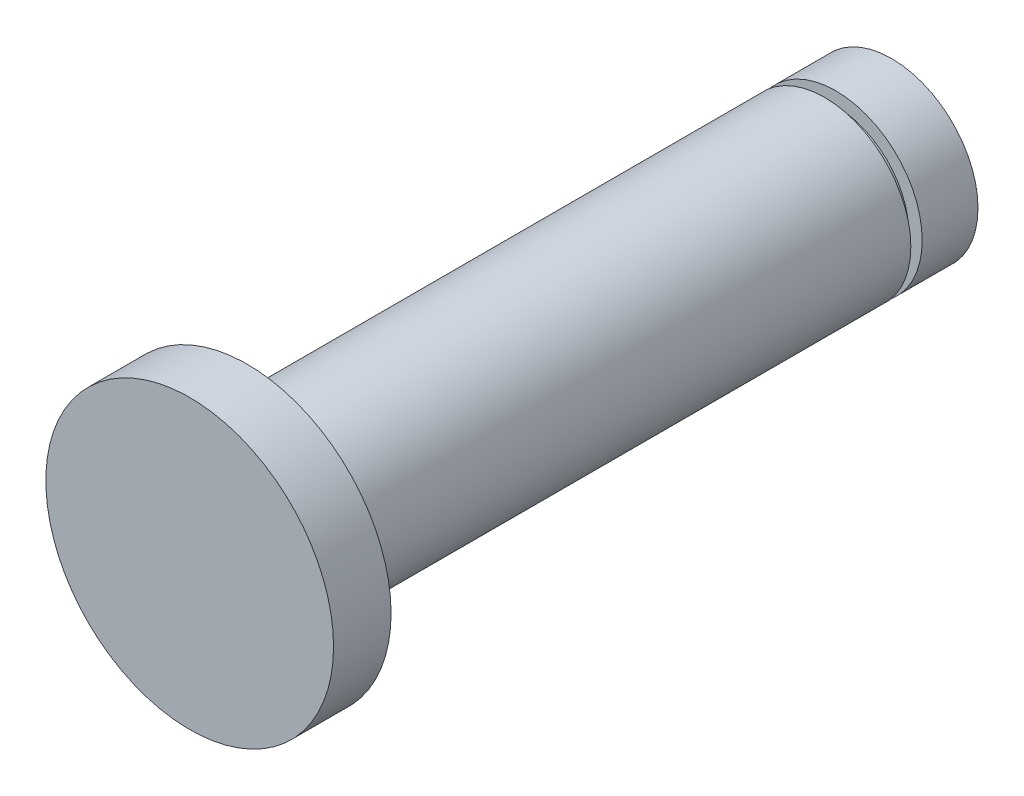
ISO-10303-21;
HEADER;
FILE_DESCRIPTION(('STEP AP214'),'2;1');
FILE_NAME('part.step','',(''),(''),'','','');
FILE_SCHEMA(('AUTOMOTIVE_DESIGN { 1 0 10303 214 1 1 1 1 }'));
ENDSEC;
DATA;
#1=APPLICATION_CONTEXT('core data for automotive mechanical design processes');
#2=APPLICATION_PROTOCOL_DEFINITION('international standard','automotive_design',2000,#1);
#3=PRODUCT_CONTEXT('',#1,'mechanical');
#4=PRODUCT('Part','Part','',(#3));
#5=PRODUCT_RELATED_PRODUCT_CATEGORY('part','',(#4));
#6=PRODUCT_DEFINITION_FORMATION('','',#4);
#7=PRODUCT_DEFINITION_CONTEXT('part definition',#1,'design');
#8=PRODUCT_DEFINITION('design','',#6,#7);
#9=PRODUCT_DEFINITION_SHAPE('','',#8);
#10=(LENGTH_UNIT() NAMED_UNIT(*) SI_UNIT(.MILLI.,.METRE.));
#11=(NAMED_UNIT(*) PLANE_ANGLE_UNIT() SI_UNIT($,.RADIAN.));
#12=(NAMED_UNIT(*) SI_UNIT($,.STERADIAN.) SOLID_ANGLE_UNIT());
#13=UNCERTAINTY_MEASURE_WITH_UNIT(LENGTH_MEASURE(1.E-05),#10,'distance_accuracy_value','');
#14=(GEOMETRIC_REPRESENTATION_CONTEXT(3) GLOBAL_UNCERTAINTY_ASSIGNED_CONTEXT((#13)) GLOBAL_UNIT_ASSIGNED_CONTEXT((#10,
#11,#12)) REPRESENTATION_CONTEXT('',''));
#15=CARTESIAN_POINT('',(0.,0.,0.));
#16=DIRECTION('',(0.,0.,1.));
#17=DIRECTION('',(1.,0.,0.));
#18=AXIS2_PLACEMENT_3D('',#15,#16,#17);
#19=CARTESIAN_POINT('',(0.,0.,112.));
#20=DIRECTION('',(0.,0.,-1.));
#21=DIRECTION('',(-1.,0.,0.));
#22=AXIS2_PLACEMENT_3D('',#19,#20,#21);
#23=CYLINDRICAL_SURFACE('',#22,15.);
#24=CARTESIAN_POINT('',(0.,0.,11.6696643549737));
#25=DIRECTION('',(0.,0.,-1.));
#26=DIRECTION('',(-1.,0.,0.));
#27=AXIS2_PLACEMENT_3D('',#24,#25,#26);
#28=CIRCLE('',#27,15.);
#29=CARTESIAN_POINT('',(-15.,0.,11.6696643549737));
#30=VERTEX_POINT('',#29);
#31=EDGE_CURVE('E57',#30,#30,#28,.T.);
#32=ORIENTED_EDGE('',*,*,#31,.F.);
#33=EDGE_LOOP('',(#32));
#34=FACE_BOUND('',#33,.T.);
#35=CARTESIAN_POINT('',(0.,0.,112.));
#36=DIRECTION('',(0.,0.,1.));
#37=DIRECTION('',(1.,0.,0.));
#38=AXIS2_PLACEMENT_3D('',#35,#36,#37);
#39=CIRCLE('',#38,15.);
#40=CARTESIAN_POINT('',(15.,0.,112.));
#41=VERTEX_POINT('',#40);
#42=EDGE_CURVE('E10',#41,#41,#39,.T.);
#43=ORIENTED_EDGE('',*,*,#42,.F.);
#44=EDGE_LOOP('',(#43));
#45=FACE_BOUND('',#44,.T.);
#46=ADVANCED_FACE('F31',(#34,#45),#23,.T.);
#47=CARTESIAN_POINT('',(0.,0.,122.));
#48=DIRECTION('',(0.,0.,-1.));
#49=DIRECTION('',(-1.,0.,0.));
#50=AXIS2_PLACEMENT_3D('',#47,#48,#49);
#51=CYLINDRICAL_SURFACE('',#50,25.);
#52=CARTESIAN_POINT('',(0.,0.,122.));
#53=DIRECTION('',(0.,0.,1.));
#54=DIRECTION('',(1.,0.,0.));
#55=AXIS2_PLACEMENT_3D('',#52,#53,#54);
#56=CIRCLE('',#55,25.);
#57=CARTESIAN_POINT('',(25.,0.,122.));
#58=VERTEX_POINT('',#57);
#59=EDGE_CURVE('E41',#58,#58,#56,.T.);
#60=ORIENTED_EDGE('',*,*,#59,.F.);
#61=EDGE_LOOP('',(#60));
#62=FACE_BOUND('',#61,.T.);
#63=CARTESIAN_POINT('',(0.,0.,112.));
#64=DIRECTION('',(0.,0.,1.));
#65=DIRECTION('',(1.,0.,0.));
#66=AXIS2_PLACEMENT_3D('',#63,#64,#65);
#67=CIRCLE('',#66,25.);
#68=CARTESIAN_POINT('',(25.,0.,112.));
#69=VERTEX_POINT('',#68);
#70=EDGE_CURVE('E43',#69,#69,#67,.T.);
#71=ORIENTED_EDGE('',*,*,#70,.T.);
#72=EDGE_LOOP('',(#71));
#73=FACE_BOUND('',#72,.T.);
#74=ADVANCED_FACE('F65',(#62,#73),#51,.T.);
#75=CARTESIAN_POINT('',(0.,0.,122.));
#76=DIRECTION('',(0.,0.,1.));
#77=DIRECTION('',(1.,0.,0.));
#78=AXIS2_PLACEMENT_3D('',#75,#76,#77);
#79=PLANE('',#78);
#80=ORIENTED_EDGE('',*,*,#59,.T.);
#81=EDGE_LOOP('',(#80));
#82=FACE_BOUND('',#81,.T.);
#83=ADVANCED_FACE('F70',(#82),#79,.T.);
#84=CARTESIAN_POINT('',(0.,0.,112.));
#85=DIRECTION('',(0.,0.,1.));
#86=DIRECTION('',(1.,0.,0.));
#87=AXIS2_PLACEMENT_3D('',#84,#85,#86);
#88=PLANE('',#87);
#89=ORIENTED_EDGE('',*,*,#42,.T.);
#90=EDGE_LOOP('',(#89));
#91=FACE_BOUND('',#90,.T.);
#92=ORIENTED_EDGE('',*,*,#70,.F.);
#93=EDGE_LOOP('',(#92));
#94=FACE_BOUND('',#93,.T.);
#95=ADVANCED_FACE('F88',(#91,#94),#88,.F.);
#96=CARTESIAN_POINT('',(0.,15.,9.7006623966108));
#97=DIRECTION('',(0.,0.,-1.));
#98=DIRECTION('',(-1.,0.,0.));
#99=AXIS2_PLACEMENT_3D('',#96,#97,#98);
#100=PLANE('',#99);
#101=CARTESIAN_POINT('',(0.,0.,9.7006623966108));
#102=DIRECTION('',(0.,0.,-1.));
#103=DIRECTION('',(-1.,0.,0.));
#104=AXIS2_PLACEMENT_3D('',#101,#102,#103);
#105=CIRCLE('',#104,15.);
#106=CARTESIAN_POINT('',(-15.,0.,9.7006623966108));
#107=VERTEX_POINT('',#106);
#108=EDGE_CURVE('E46',#107,#107,#105,.T.);
#109=ORIENTED_EDGE('',*,*,#108,.F.);
#110=EDGE_LOOP('',(#109));
#111=FACE_BOUND('',#110,.T.);
#112=CARTESIAN_POINT('',(0.,0.,9.7006623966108));
#113=DIRECTION('',(0.,0.,-1.));
#114=DIRECTION('',(-1.,0.,0.));
#115=AXIS2_PLACEMENT_3D('',#112,#113,#114);
#116=CIRCLE('',#115,12.6686657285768);
#117=CARTESIAN_POINT('',(-12.6686657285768,0.,9.7006623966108));
#118=VERTEX_POINT('',#117);
#119=EDGE_CURVE('E51',#118,#118,#116,.T.);
#120=ORIENTED_EDGE('',*,*,#119,.T.);
#121=EDGE_LOOP('',(#120));
#122=FACE_BOUND('',#121,.T.);
#123=ADVANCED_FACE('F84',(#111,#122),#100,.F.);
#124=CARTESIAN_POINT('',(0.,0.,0.));
#125=DIRECTION('',(0.,0.,-1.));
#126=DIRECTION('',(-1.,0.,0.));
#127=AXIS2_PLACEMENT_3D('',#124,#125,#126);
#128=CYLINDRICAL_SURFACE('',#127,12.6686657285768);
#129=ORIENTED_EDGE('',*,*,#119,.F.);
#130=EDGE_LOOP('',(#129));
#131=FACE_BOUND('',#130,.T.);
#132=CARTESIAN_POINT('',(0.,0.,11.6696643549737));
#133=DIRECTION('',(0.,0.,-1.));
#134=DIRECTION('',(-1.,0.,0.));
#135=AXIS2_PLACEMENT_3D('',#132,#133,#134);
#136=CIRCLE('',#135,12.6686657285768);
#137=CARTESIAN_POINT('',(-12.6686657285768,0.,11.6696643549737));
#138=VERTEX_POINT('',#137);
#139=EDGE_CURVE('E54',#138,#138,#136,.T.);
#140=ORIENTED_EDGE('',*,*,#139,.T.);
#141=EDGE_LOOP('',(#140));
#142=FACE_BOUND('',#141,.T.);
#143=ADVANCED_FACE('F87',(#131,#142),#128,.T.);
#144=CARTESIAN_POINT('',(0.,12.6686657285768,11.6696643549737));
#145=DIRECTION('',(0.,0.,1.));
#146=DIRECTION('',(1.,0.,0.));
#147=AXIS2_PLACEMENT_3D('',#144,#145,#146);
#148=PLANE('',#147);
#149=ORIENTED_EDGE('',*,*,#139,.F.);
#150=EDGE_LOOP('',(#149));
#151=FACE_BOUND('',#150,.T.);
#152=ORIENTED_EDGE('',*,*,#31,.T.);
#153=EDGE_LOOP('',(#152));
#154=FACE_BOUND('',#153,.T.);
#155=ADVANCED_FACE('F61',(#151,#154),#148,.F.);
#156=CARTESIAN_POINT('',(0.,0.,0.));
#157=DIRECTION('',(0.,0.,1.));
#158=DIRECTION('',(1.,0.,0.));
#159=AXIS2_PLACEMENT_3D('',#156,#157,#158);
#160=PLANE('',#159);
#161=CARTESIAN_POINT('',(0.,0.,0.));
#162=DIRECTION('',(0.,0.,1.));
#163=DIRECTION('',(1.,0.,0.));
#164=AXIS2_PLACEMENT_3D('',#161,#162,#163);
#165=CIRCLE('',#164,15.);
#166=CARTESIAN_POINT('',(15.,0.,0.));
#167=VERTEX_POINT('',#166);
#168=EDGE_CURVE('E34',#167,#167,#165,.T.);
#169=ORIENTED_EDGE('',*,*,#168,.F.);
#170=EDGE_LOOP('',(#169));
#171=FACE_BOUND('',#170,.T.);
#172=ADVANCED_FACE('F74',(#171),#160,.F.);
#173=ORIENTED_EDGE('',*,*,#108,.T.);
#174=EDGE_LOOP('',(#173));
#175=FACE_BOUND('',#174,.T.);
#176=ORIENTED_EDGE('',*,*,#168,.T.);
#177=EDGE_LOOP('',(#176));
#178=FACE_BOUND('',#177,.T.);
#179=ADVANCED_FACE('F66',(#175,#178),#23,.T.);
#180=CLOSED_SHELL('',(#46,#74,#83,#95,#123,#143,#155,#172,#179));
#181=MANIFOLD_SOLID_BREP('B2',#180);
#182=ADVANCED_BREP_SHAPE_REPRESENTATION('',(#18,#181),#14);
#183=SHAPE_DEFINITION_REPRESENTATION(#9,#182);
ENDSEC;
END-ISO-10303-21;
